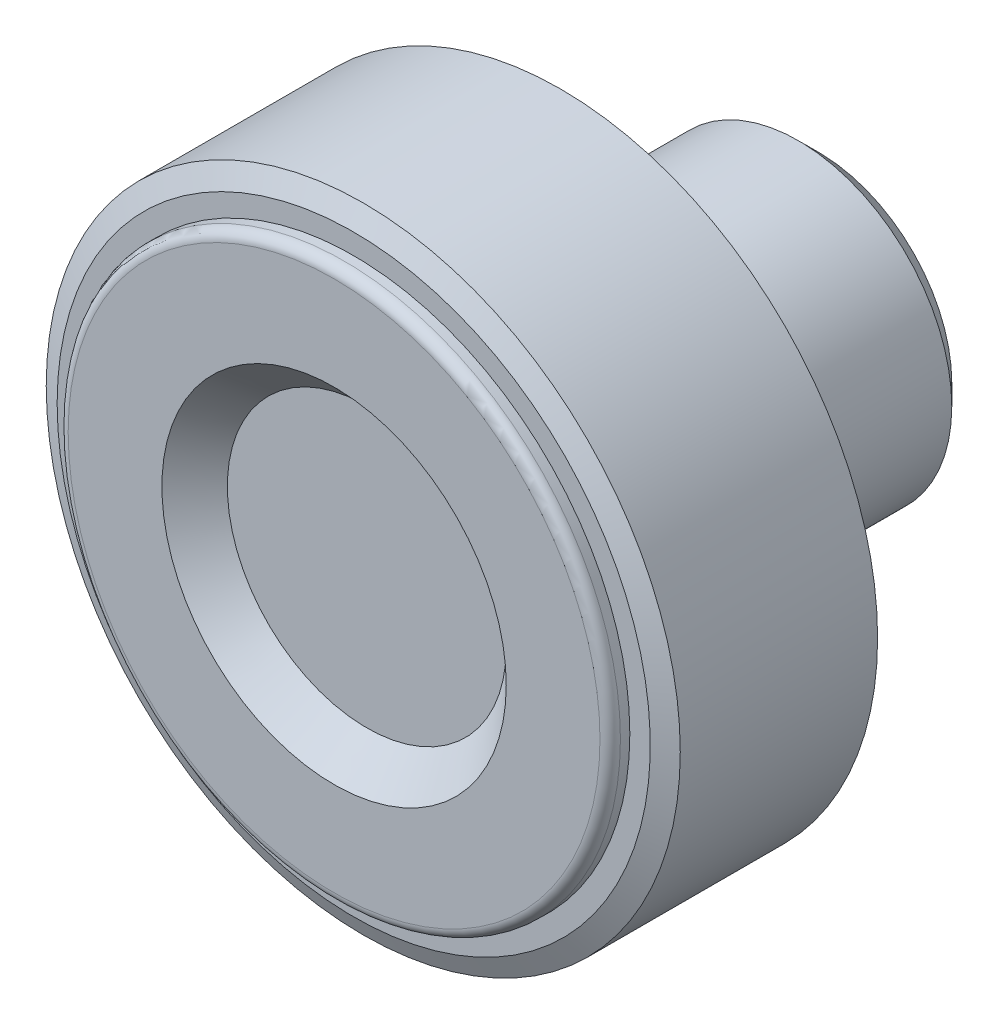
ISO-10303-21;
HEADER;
FILE_DESCRIPTION(('STEP AP214'),'2;1');
FILE_NAME('part.step','',(''),(''),'','','');
FILE_SCHEMA(('AUTOMOTIVE_DESIGN { 1 0 10303 214 1 1 1 1 }'));
ENDSEC;
DATA;
#1=APPLICATION_CONTEXT('core data for automotive mechanical design processes');
#2=APPLICATION_PROTOCOL_DEFINITION('international standard','automotive_design',2000,#1);
#3=PRODUCT_CONTEXT('',#1,'mechanical');
#4=PRODUCT('Part','Part','',(#3));
#5=PRODUCT_RELATED_PRODUCT_CATEGORY('part','',(#4));
#6=PRODUCT_DEFINITION_FORMATION('','',#4);
#7=PRODUCT_DEFINITION_CONTEXT('part definition',#1,'design');
#8=PRODUCT_DEFINITION('design','',#6,#7);
#9=PRODUCT_DEFINITION_SHAPE('','',#8);
#10=(LENGTH_UNIT() NAMED_UNIT(*) SI_UNIT(.MILLI.,.METRE.));
#11=(NAMED_UNIT(*) PLANE_ANGLE_UNIT() SI_UNIT($,.RADIAN.));
#12=(NAMED_UNIT(*) SI_UNIT($,.STERADIAN.) SOLID_ANGLE_UNIT());
#13=UNCERTAINTY_MEASURE_WITH_UNIT(LENGTH_MEASURE(1.E-05),#10,'distance_accuracy_value','');
#14=(GEOMETRIC_REPRESENTATION_CONTEXT(3) GLOBAL_UNCERTAINTY_ASSIGNED_CONTEXT((#13)) GLOBAL_UNIT_ASSIGNED_CONTEXT((#10,
#11,#12)) REPRESENTATION_CONTEXT('',''));
#15=CARTESIAN_POINT('',(0.,0.,0.));
#16=DIRECTION('',(0.,0.,1.));
#17=DIRECTION('',(1.,0.,0.));
#18=AXIS2_PLACEMENT_3D('',#15,#16,#17);
#19=CARTESIAN_POINT('',(0.,0.,0.));
#20=DIRECTION('',(0.,0.,-1.));
#21=DIRECTION('',(-1.,0.,0.));
#22=AXIS2_PLACEMENT_3D('',#19,#20,#21);
#23=CYLINDRICAL_SURFACE('',#22,15.5);
#24=CARTESIAN_POINT('',(0.,0.,22.573692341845));
#25=DIRECTION('',(0.,0.,-1.));
#26=DIRECTION('',(-1.,0.,0.));
#27=AXIS2_PLACEMENT_3D('',#24,#25,#26);
#28=CIRCLE('',#27,15.5);
#29=CARTESIAN_POINT('',(-15.5,0.,22.573692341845));
#30=VERTEX_POINT('',#29);
#31=EDGE_CURVE('E157',#30,#30,#28,.T.);
#32=ORIENTED_EDGE('',*,*,#31,.T.);
#33=EDGE_LOOP('',(#32));
#34=FACE_BOUND('',#33,.T.);
#35=CARTESIAN_POINT('',(0.,0.,12.926307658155));
#36=DIRECTION('',(0.,0.,1.));
#37=DIRECTION('',(0.,1.,0.));
#38=AXIS2_PLACEMENT_3D('',#35,#36,#37);
#39=CIRCLE('',#38,15.5);
#40=CARTESIAN_POINT('',(0.,15.5,12.926307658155));
#41=VERTEX_POINT('',#40);
#42=EDGE_CURVE('E153',#41,#41,#39,.F.);
#43=ORIENTED_EDGE('',*,*,#42,.F.);
#44=EDGE_LOOP('',(#43));
#45=FACE_BOUND('',#44,.T.);
#46=ADVANCED_FACE('F14',(#34,#45),#23,.T.);
#47=CARTESIAN_POINT('',(0.,0.,12.926307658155));
#48=DIRECTION('',(0.,0.,1.));
#49=DIRECTION('',(1.,0.,0.));
#50=AXIS2_PLACEMENT_3D('',#47,#48,#49);
#51=CONICAL_SURFACE('',#50,15.5,1.13446401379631);
#52=ORIENTED_EDGE('',*,*,#42,.T.);
#53=EDGE_LOOP('',(#52));
#54=FACE_BOUND('',#53,.T.);
#55=CARTESIAN_POINT('',(0.,0.,12.46));
#56=DIRECTION('',(0.,0.,1.));
#57=DIRECTION('',(1.,0.,0.));
#58=AXIS2_PLACEMENT_3D('',#55,#56,#57);
#59=CIRCLE('',#58,14.5);
#60=CARTESIAN_POINT('',(14.5,0.,12.46));
#61=VERTEX_POINT('',#60);
#62=EDGE_CURVE('E150',#61,#61,#59,.F.);
#63=ORIENTED_EDGE('',*,*,#62,.F.);
#64=EDGE_LOOP('',(#63));
#65=FACE_BOUND('',#64,.T.);
#66=ADVANCED_FACE('F397',(#54,#65),#51,.T.);
#67=CARTESIAN_POINT('',(0.,14.,12.46));
#68=DIRECTION('',(0.,0.,-1.));
#69=DIRECTION('',(-1.,0.,0.));
#70=AXIS2_PLACEMENT_3D('',#67,#68,#69);
#71=PLANE('',#70);
#72=ORIENTED_EDGE('',*,*,#62,.T.);
#73=EDGE_LOOP('',(#72));
#74=FACE_BOUND('',#73,.T.);
#75=CARTESIAN_POINT('',(0.,0.,12.46));
#76=DIRECTION('',(0.,0.,1.));
#77=DIRECTION('',(1.,0.,0.));
#78=AXIS2_PLACEMENT_3D('',#75,#76,#77);
#79=CIRCLE('',#78,13.5);
#80=CARTESIAN_POINT('',(13.5,0.,12.46));
#81=VERTEX_POINT('',#80);
#82=EDGE_CURVE('E146',#81,#81,#79,.F.);
#83=ORIENTED_EDGE('',*,*,#82,.F.);
#84=EDGE_LOOP('',(#83));
#85=FACE_BOUND('',#84,.T.);
#86=ADVANCED_FACE('F407',(#74,#85),#71,.T.);
#87=CARTESIAN_POINT('',(0.,0.,12.23));
#88=DIRECTION('',(0.,0.,1.));
#89=DIRECTION('',(1.,0.,0.));
#90=AXIS2_PLACEMENT_3D('',#87,#88,#89);
#91=CYLINDRICAL_SURFACE('',#90,13.5);
#92=ORIENTED_EDGE('',*,*,#82,.T.);
#93=EDGE_LOOP('',(#92));
#94=FACE_BOUND('',#93,.T.);
#95=CARTESIAN_POINT('',(0.,0.,12.));
#96=DIRECTION('',(0.,0.,-1.));
#97=DIRECTION('',(-1.,0.,0.));
#98=AXIS2_PLACEMENT_3D('',#95,#96,#97);
#99=CIRCLE('',#98,13.5);
#100=CARTESIAN_POINT('',(-13.5,0.,12.));
#101=VERTEX_POINT('',#100);
#102=EDGE_CURVE('E149',#101,#101,#99,.T.);
#103=ORIENTED_EDGE('',*,*,#102,.F.);
#104=EDGE_LOOP('',(#103));
#105=FACE_BOUND('',#104,.T.);
#106=ADVANCED_FACE('F583',(#94,#105),#91,.T.);
#107=CARTESIAN_POINT('',(0.,0.,12.));
#108=DIRECTION('',(0.,0.,-1.));
#109=DIRECTION('',(-1.,0.,0.));
#110=AXIS2_PLACEMENT_3D('',#107,#108,#109);
#111=TOROIDAL_SURFACE('',#110,13.,0.5);
#112=ORIENTED_EDGE('',*,*,#102,.T.);
#113=EDGE_LOOP('',(#112));
#114=FACE_BOUND('',#113,.T.);
#115=CARTESIAN_POINT('',(0.,0.,11.5));
#116=DIRECTION('',(0.,0.,1.));
#117=DIRECTION('',(1.,0.,0.));
#118=AXIS2_PLACEMENT_3D('',#115,#116,#117);
#119=CIRCLE('',#118,13.);
#120=CARTESIAN_POINT('',(0.,13.,11.5));
#121=VERTEX_POINT('',#120);
#122=CARTESIAN_POINT('',(13.,0.,11.5));
#123=VERTEX_POINT('',#122);
#124=EDGE_CURVE('E305',#121,#123,#119,.F.);
#125=ORIENTED_EDGE('',*,*,#124,.F.);
#126=CARTESIAN_POINT('',(0.,0.,11.5));
#127=DIRECTION('',(0.,0.,1.));
#128=DIRECTION('',(0.,1.,0.));
#129=AXIS2_PLACEMENT_3D('',#126,#127,#128);
#130=CIRCLE('',#129,13.);
#131=CARTESIAN_POINT('',(-13.,0.,11.5));
#132=VERTEX_POINT('',#131);
#133=EDGE_CURVE('E145',#132,#121,#130,.F.);
#134=ORIENTED_EDGE('',*,*,#133,.F.);
#135=CARTESIAN_POINT('',(0.,0.,11.5));
#136=DIRECTION('',(0.,0.,1.));
#137=DIRECTION('',(-1.,0.,0.));
#138=AXIS2_PLACEMENT_3D('',#135,#136,#137);
#139=CIRCLE('',#138,13.);
#140=EDGE_CURVE('E340',#123,#132,#139,.F.);
#141=ORIENTED_EDGE('',*,*,#140,.F.);
#142=EDGE_LOOP('',(#125,#134,#141));
#143=FACE_BOUND('',#142,.T.);
#144=ADVANCED_FACE('F322',(#114,#143),#111,.T.);
#145=CARTESIAN_POINT('',(0.,12.4615384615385,11.5));
#146=DIRECTION('',(0.,0.,-1.));
#147=DIRECTION('',(-1.,0.,0.));
#148=AXIS2_PLACEMENT_3D('',#145,#146,#147);
#149=PLANE('',#148);
#150=ORIENTED_EDGE('',*,*,#140,.T.);
#151=ORIENTED_EDGE('',*,*,#133,.T.);
#152=ORIENTED_EDGE('',*,*,#124,.T.);
#153=EDGE_LOOP('',(#150,#151,#152));
#154=FACE_BOUND('',#153,.T.);
#155=CARTESIAN_POINT('',(0.,0.,11.5));
#156=DIRECTION('',(0.,0.,1.));
#157=DIRECTION('',(1.,0.,0.));
#158=AXIS2_PLACEMENT_3D('',#155,#156,#157);
#159=CIRCLE('',#158,11.9230769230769);
#160=CARTESIAN_POINT('',(11.9230769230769,0.,11.5));
#161=VERTEX_POINT('',#160);
#162=EDGE_CURVE('E142',#161,#161,#159,.T.);
#163=ORIENTED_EDGE('',*,*,#162,.T.);
#164=EDGE_LOOP('',(#163));
#165=FACE_BOUND('',#164,.T.);
#166=ADVANCED_FACE('F311',(#154,#165),#149,.T.);
#167=CARTESIAN_POINT('',(0.,1.66666666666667,0.));
#168=DIRECTION('',(0.,0.,-1.));
#169=DIRECTION('',(-1.,0.,0.));
#170=AXIS2_PLACEMENT_3D('',#167,#168,#169);
#171=PLANE('',#170);
#172=CARTESIAN_POINT('',(0.,0.,0.));
#173=DIRECTION('',(0.,0.,-1.));
#174=DIRECTION('',(-1.,0.,0.));
#175=AXIS2_PLACEMENT_3D('',#172,#173,#174);
#176=CIRCLE('',#175,2.94999999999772);
#177=CARTESIAN_POINT('',(-2.94999999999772,0.,0.));
#178=VERTEX_POINT('',#177);
#179=EDGE_CURVE('E9',#178,#178,#176,.F.);
#180=ORIENTED_EDGE('',*,*,#179,.T.);
#181=EDGE_LOOP('',(#180));
#182=FACE_BOUND('',#181,.T.);
#183=CARTESIAN_POINT('',(0.,0.,0.));
#184=DIRECTION('',(0.,0.,1.));
#185=DIRECTION('',(1.,0.,0.));
#186=AXIS2_PLACEMENT_3D('',#183,#184,#185);
#187=CIRCLE('',#186,3.33333333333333);
#188=CARTESIAN_POINT('',(3.33333333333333,0.,0.));
#189=VERTEX_POINT('',#188);
#190=EDGE_CURVE('E139',#189,#189,#187,.T.);
#191=ORIENTED_EDGE('',*,*,#190,.F.);
#192=EDGE_LOOP('',(#191));
#193=FACE_BOUND('',#192,.T.);
#194=ADVANCED_FACE('F321',(#182,#193),#171,.T.);
#195=CARTESIAN_POINT('',(0.,0.,15.25));
#196=DIRECTION('',(0.,0.,1.));
#197=DIRECTION('',(1.,0.,0.));
#198=AXIS2_PLACEMENT_3D('',#195,#196,#197);
#199=CYLINDRICAL_SURFACE('',#198,11.9230769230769);
#200=CARTESIAN_POINT('',(0.,0.,19.));
#201=DIRECTION('',(0.,0.,-1.));
#202=DIRECTION('',(-1.,0.,0.));
#203=AXIS2_PLACEMENT_3D('',#200,#201,#202);
#204=CIRCLE('',#203,11.9230769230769);
#205=CARTESIAN_POINT('',(-11.9230769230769,0.,19.));
#206=VERTEX_POINT('',#205);
#207=EDGE_CURVE('E138',#206,#206,#204,.F.);
#208=ORIENTED_EDGE('',*,*,#207,.T.);
#209=EDGE_LOOP('',(#208));
#210=FACE_BOUND('',#209,.T.);
#211=ORIENTED_EDGE('',*,*,#162,.F.);
#212=EDGE_LOOP('',(#211));
#213=FACE_BOUND('',#212,.T.);
#214=ADVANCED_FACE('F449',(#210,#213),#199,.F.);
#215=CARTESIAN_POINT('',(0.,0.,0.15));
#216=DIRECTION('',(0.,0.,1.));
#217=DIRECTION('',(1.,0.,0.));
#218=AXIS2_PLACEMENT_3D('',#215,#216,#217);
#219=CYLINDRICAL_SURFACE('',#218,3.33333333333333);
#220=ORIENTED_EDGE('',*,*,#190,.T.);
#221=EDGE_LOOP('',(#220));
#222=FACE_BOUND('',#221,.T.);
#223=CARTESIAN_POINT('',(0.,0.,0.3));
#224=DIRECTION('',(0.,0.,1.));
#225=DIRECTION('',(1.,0.,0.));
#226=AXIS2_PLACEMENT_3D('',#223,#224,#225);
#227=CIRCLE('',#226,3.33333333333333);
#228=CARTESIAN_POINT('',(3.33333333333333,0.,0.3));
#229=VERTEX_POINT('',#228);
#230=EDGE_CURVE('E134',#229,#229,#227,.T.);
#231=ORIENTED_EDGE('',*,*,#230,.F.);
#232=EDGE_LOOP('',(#231));
#233=FACE_BOUND('',#232,.T.);
#234=ADVANCED_FACE('F281',(#222,#233),#219,.T.);
#235=CARTESIAN_POINT('',(0.,0.,19.));
#236=DIRECTION('',(0.,0.,-1.));
#237=DIRECTION('',(-1.,0.,0.));
#238=AXIS2_PLACEMENT_3D('',#235,#236,#237);
#239=TOROIDAL_SURFACE('',#238,10.9230769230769,1.);
#240=CARTESIAN_POINT('',(0.,0.,20.));
#241=DIRECTION('',(0.,0.,1.));
#242=DIRECTION('',(0.,1.,0.));
#243=AXIS2_PLACEMENT_3D('',#240,#241,#242);
#244=CIRCLE('',#243,10.9230769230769);
#245=CARTESIAN_POINT('',(-10.9230769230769,0.,20.));
#246=VERTEX_POINT('',#245);
#247=CARTESIAN_POINT('',(0.,10.9230769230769,20.));
#248=VERTEX_POINT('',#247);
#249=EDGE_CURVE('E133',#246,#248,#244,.F.);
#250=ORIENTED_EDGE('',*,*,#249,.F.);
#251=CARTESIAN_POINT('',(0.,0.,20.));
#252=DIRECTION('',(0.,0.,1.));
#253=DIRECTION('',(-1.,0.,0.));
#254=AXIS2_PLACEMENT_3D('',#251,#252,#253);
#255=CIRCLE('',#254,10.9230769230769);
#256=CARTESIAN_POINT('',(10.9230769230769,0.,20.));
#257=VERTEX_POINT('',#256);
#258=EDGE_CURVE('E656',#257,#246,#255,.F.);
#259=ORIENTED_EDGE('',*,*,#258,.F.);
#260=CARTESIAN_POINT('',(0.,0.,20.));
#261=DIRECTION('',(0.,0.,1.));
#262=DIRECTION('',(1.,0.,0.));
#263=AXIS2_PLACEMENT_3D('',#260,#261,#262);
#264=CIRCLE('',#263,10.9230769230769);
#265=EDGE_CURVE('E137',#248,#257,#264,.F.);
#266=ORIENTED_EDGE('',*,*,#265,.F.);
#267=EDGE_LOOP('',(#250,#259,#266));
#268=FACE_BOUND('',#267,.T.);
#269=ORIENTED_EDGE('',*,*,#207,.F.);
#270=EDGE_LOOP('',(#269));
#271=FACE_BOUND('',#270,.T.);
#272=ADVANCED_FACE('F277',(#268,#271),#239,.F.);
#273=CARTESIAN_POINT('',(0.,4.91666666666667,0.3));
#274=DIRECTION('',(0.,0.,-1.));
#275=DIRECTION('',(-1.,0.,0.));
#276=AXIS2_PLACEMENT_3D('',#273,#274,#275);
#277=PLANE('',#276);
#278=CARTESIAN_POINT('',(0.,0.,0.3));
#279=DIRECTION('',(0.,0.,1.));
#280=DIRECTION('',(1.,0.,0.));
#281=AXIS2_PLACEMENT_3D('',#278,#279,#280);
#282=CIRCLE('',#281,6.5);
#283=CARTESIAN_POINT('',(6.5,0.,0.3));
#284=VERTEX_POINT('',#283);
#285=EDGE_CURVE('E124',#284,#284,#282,.T.);
#286=ORIENTED_EDGE('',*,*,#285,.F.);
#287=EDGE_LOOP('',(#286));
#288=FACE_BOUND('',#287,.T.);
#289=ORIENTED_EDGE('',*,*,#230,.T.);
#290=EDGE_LOOP('',(#289));
#291=FACE_BOUND('',#290,.T.);
#292=ADVANCED_FACE('F214',(#288,#291),#277,.T.);
#293=CARTESIAN_POINT('',(0.,9.71153846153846,20.));
#294=DIRECTION('',(0.,0.,-1.));
#295=DIRECTION('',(-1.,0.,0.));
#296=AXIS2_PLACEMENT_3D('',#293,#294,#295);
#297=PLANE('',#296);
#298=ORIENTED_EDGE('',*,*,#258,.T.);
#299=ORIENTED_EDGE('',*,*,#249,.T.);
#300=ORIENTED_EDGE('',*,*,#265,.T.);
#301=EDGE_LOOP('',(#298,#299,#300));
#302=FACE_BOUND('',#301,.T.);
#303=CARTESIAN_POINT('',(0.,0.,20.));
#304=DIRECTION('',(0.,0.,-1.));
#305=DIRECTION('',(-1.,0.,0.));
#306=AXIS2_PLACEMENT_3D('',#303,#304,#305);
#307=CIRCLE('',#306,8.5);
#308=CARTESIAN_POINT('',(0.,8.5,20.));
#309=VERTEX_POINT('',#308);
#310=CARTESIAN_POINT('',(-8.5,0.,20.));
#311=VERTEX_POINT('',#310);
#312=EDGE_CURVE('E31',#309,#311,#307,.F.);
#313=ORIENTED_EDGE('',*,*,#312,.T.);
#314=CARTESIAN_POINT('',(0.,0.,20.));
#315=DIRECTION('',(0.,0.,-1.));
#316=DIRECTION('',(1.,0.,0.));
#317=AXIS2_PLACEMENT_3D('',#314,#315,#316);
#318=CIRCLE('',#317,8.5);
#319=CARTESIAN_POINT('',(8.5,0.,20.));
#320=VERTEX_POINT('',#319);
#321=EDGE_CURVE('E132',#311,#320,#318,.F.);
#322=ORIENTED_EDGE('',*,*,#321,.T.);
#323=CARTESIAN_POINT('',(0.,0.,20.));
#324=DIRECTION('',(0.,0.,-1.));
#325=DIRECTION('',(0.,1.,0.));
#326=AXIS2_PLACEMENT_3D('',#323,#324,#325);
#327=CIRCLE('',#326,8.5);
#328=EDGE_CURVE('E201',#320,#309,#327,.F.);
#329=ORIENTED_EDGE('',*,*,#328,.T.);
#330=EDGE_LOOP('',(#313,#322,#329));
#331=FACE_BOUND('',#330,.T.);
#332=ADVANCED_FACE('F205',(#302,#331),#297,.T.);
#333=CARTESIAN_POINT('',(0.,0.,1.3));
#334=DIRECTION('',(0.,0.,1.));
#335=DIRECTION('',(1.,0.,0.));
#336=AXIS2_PLACEMENT_3D('',#333,#334,#335);
#337=CONICAL_SURFACE('',#336,7.5,0.785398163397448);
#338=ORIENTED_EDGE('',*,*,#285,.T.);
#339=EDGE_LOOP('',(#338));
#340=FACE_BOUND('',#339,.T.);
#341=CARTESIAN_POINT('',(0.,0.,1.3));
#342=DIRECTION('',(0.,0.,1.));
#343=DIRECTION('',(1.,0.,0.));
#344=AXIS2_PLACEMENT_3D('',#341,#342,#343);
#345=CIRCLE('',#344,7.5);
#346=CARTESIAN_POINT('',(7.5,0.,1.3));
#347=VERTEX_POINT('',#346);
#348=EDGE_CURVE('E266',#347,#347,#345,.T.);
#349=ORIENTED_EDGE('',*,*,#348,.F.);
#350=EDGE_LOOP('',(#349));
#351=FACE_BOUND('',#350,.T.);
#352=ADVANCED_FACE('F188',(#340,#351),#337,.T.);
#353=CARTESIAN_POINT('',(0.,0.,19.));
#354=DIRECTION('',(0.,0.,-1.));
#355=DIRECTION('',(-1.,0.,0.));
#356=AXIS2_PLACEMENT_3D('',#353,#354,#355);
#357=TOROIDAL_SURFACE('',#356,8.5,1.);
#358=CARTESIAN_POINT('',(0.,0.,19.));
#359=DIRECTION('',(0.,0.,1.));
#360=DIRECTION('',(1.,0.,0.));
#361=AXIS2_PLACEMENT_3D('',#358,#359,#360);
#362=CIRCLE('',#361,7.5);
#363=CARTESIAN_POINT('',(7.5,0.,19.));
#364=VERTEX_POINT('',#363);
#365=EDGE_CURVE('E198',#364,#364,#362,.F.);
#366=ORIENTED_EDGE('',*,*,#365,.F.);
#367=EDGE_LOOP('',(#366));
#368=FACE_BOUND('',#367,.T.);
#369=ORIENTED_EDGE('',*,*,#321,.F.);
#370=ORIENTED_EDGE('',*,*,#312,.F.);
#371=ORIENTED_EDGE('',*,*,#328,.F.);
#372=EDGE_LOOP('',(#369,#370,#371));
#373=FACE_BOUND('',#372,.T.);
#374=ADVANCED_FACE('F176',(#368,#373),#357,.F.);
#375=CARTESIAN_POINT('',(0.,0.,10.15));
#376=DIRECTION('',(0.,0.,1.));
#377=DIRECTION('',(1.,0.,0.));
#378=AXIS2_PLACEMENT_3D('',#375,#376,#377);
#379=CYLINDRICAL_SURFACE('',#378,7.5);
#380=ORIENTED_EDGE('',*,*,#348,.T.);
#381=EDGE_LOOP('',(#380));
#382=FACE_BOUND('',#381,.T.);
#383=ORIENTED_EDGE('',*,*,#365,.T.);
#384=EDGE_LOOP('',(#383));
#385=FACE_BOUND('',#384,.T.);
#386=ADVANCED_FACE('F187',(#382,#385),#379,.T.);
#387=CARTESIAN_POINT('',(0.,3.40909090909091,22.4));
#388=DIRECTION('',(0.,0.,1.));
#389=DIRECTION('',(1.,0.,0.));
#390=AXIS2_PLACEMENT_3D('',#387,#388,#389);
#391=PLANE('',#390);
#392=CARTESIAN_POINT('',(0.,0.,22.4));
#393=DIRECTION('',(0.,0.,1.));
#394=DIRECTION('',(1.,0.,0.));
#395=AXIS2_PLACEMENT_3D('',#392,#393,#394);
#396=CIRCLE('',#395,6.81818181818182);
#397=CARTESIAN_POINT('',(6.81818181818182,0.,22.4));
#398=VERTEX_POINT('',#397);
#399=EDGE_CURVE('E164',#398,#398,#396,.T.);
#400=ORIENTED_EDGE('',*,*,#399,.T.);
#401=EDGE_LOOP('',(#400));
#402=FACE_BOUND('',#401,.T.);
#403=ADVANCED_FACE('F366',(#402),#391,.T.);
#404=CARTESIAN_POINT('',(0.,0.,24.));
#405=DIRECTION('',(0.,0.,1.));
#406=DIRECTION('',(1.,0.,0.));
#407=AXIS2_PLACEMENT_3D('',#404,#405,#406);
#408=CONICAL_SURFACE('',#407,8.41818181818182,0.785398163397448);
#409=CARTESIAN_POINT('',(0.,0.,24.));
#410=DIRECTION('',(0.,0.,1.));
#411=DIRECTION('',(1.,0.,0.));
#412=AXIS2_PLACEMENT_3D('',#409,#410,#411);
#413=CIRCLE('',#412,8.41818181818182);
#414=CARTESIAN_POINT('',(8.41818181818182,0.,24.));
#415=VERTEX_POINT('',#414);
#416=EDGE_CURVE('E75',#415,#415,#413,.F.);
#417=ORIENTED_EDGE('',*,*,#416,.F.);
#418=EDGE_LOOP('',(#417));
#419=FACE_BOUND('',#418,.T.);
#420=ORIENTED_EDGE('',*,*,#399,.F.);
#421=EDGE_LOOP('',(#420));
#422=FACE_BOUND('',#421,.T.);
#423=ADVANCED_FACE('F98',(#419,#422),#408,.F.);
#424=CARTESIAN_POINT('',(0.,10.7090909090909,24.));
#425=DIRECTION('',(0.,0.,1.));
#426=DIRECTION('',(1.,0.,0.));
#427=AXIS2_PLACEMENT_3D('',#424,#425,#426);
#428=PLANE('',#427);
#429=ORIENTED_EDGE('',*,*,#416,.T.);
#430=EDGE_LOOP('',(#429));
#431=FACE_BOUND('',#430,.T.);
#432=CARTESIAN_POINT('',(0.,0.,24.));
#433=DIRECTION('',(0.,0.,-1.));
#434=DIRECTION('',(-1.,0.,0.));
#435=AXIS2_PLACEMENT_3D('',#432,#433,#434);
#436=CIRCLE('',#435,13.);
#437=CARTESIAN_POINT('',(-13.,0.,24.));
#438=VERTEX_POINT('',#437);
#439=CARTESIAN_POINT('',(0.,13.,24.));
#440=VERTEX_POINT('',#439);
#441=EDGE_CURVE('E69',#438,#440,#436,.T.);
#442=ORIENTED_EDGE('',*,*,#441,.F.);
#443=CARTESIAN_POINT('',(0.,0.,24.));
#444=DIRECTION('',(0.,0.,-1.));
#445=DIRECTION('',(1.,0.,0.));
#446=AXIS2_PLACEMENT_3D('',#443,#444,#445);
#447=CIRCLE('',#446,13.);
#448=CARTESIAN_POINT('',(13.,0.,24.));
#449=VERTEX_POINT('',#448);
#450=EDGE_CURVE('E64',#449,#438,#447,.T.);
#451=ORIENTED_EDGE('',*,*,#450,.F.);
#452=CARTESIAN_POINT('',(0.,0.,24.));
#453=DIRECTION('',(0.,0.,-1.));
#454=DIRECTION('',(0.,1.,0.));
#455=AXIS2_PLACEMENT_3D('',#452,#453,#454);
#456=CIRCLE('',#455,13.);
#457=EDGE_CURVE('E71',#440,#449,#456,.T.);
#458=ORIENTED_EDGE('',*,*,#457,.F.);
#459=EDGE_LOOP('',(#442,#451,#458));
#460=FACE_BOUND('',#459,.T.);
#461=ADVANCED_FACE('F79',(#431,#460),#428,.T.);
#462=CARTESIAN_POINT('',(0.,0.,23.5));
#463=DIRECTION('',(0.,0.,-1.));
#464=DIRECTION('',(-1.,0.,0.));
#465=AXIS2_PLACEMENT_3D('',#462,#463,#464);
#466=TOROIDAL_SURFACE('',#465,13.,0.5);
#467=ORIENTED_EDGE('',*,*,#450,.T.);
#468=ORIENTED_EDGE('',*,*,#441,.T.);
#469=ORIENTED_EDGE('',*,*,#457,.T.);
#470=EDGE_LOOP('',(#467,#468,#469));
#471=FACE_BOUND('',#470,.T.);
#472=CARTESIAN_POINT('',(0.,0.,23.5));
#473=DIRECTION('',(0.,0.,1.));
#474=DIRECTION('',(1.,0.,0.));
#475=AXIS2_PLACEMENT_3D('',#472,#473,#474);
#476=CIRCLE('',#475,13.5);
#477=CARTESIAN_POINT('',(13.5,0.,23.5));
#478=VERTEX_POINT('',#477);
#479=EDGE_CURVE('E161',#478,#478,#476,.F.);
#480=ORIENTED_EDGE('',*,*,#479,.F.);
#481=EDGE_LOOP('',(#480));
#482=FACE_BOUND('',#481,.T.);
#483=ADVANCED_FACE('F67',(#471,#482),#466,.T.);
#484=CARTESIAN_POINT('',(0.,0.,23.27));
#485=DIRECTION('',(0.,0.,1.));
#486=DIRECTION('',(1.,0.,0.));
#487=AXIS2_PLACEMENT_3D('',#484,#485,#486);
#488=CYLINDRICAL_SURFACE('',#487,13.5);
#489=CARTESIAN_POINT('',(0.,0.,23.04));
#490=DIRECTION('',(0.,0.,1.));
#491=DIRECTION('',(1.,0.,0.));
#492=AXIS2_PLACEMENT_3D('',#489,#490,#491);
#493=CIRCLE('',#492,13.5);
#494=CARTESIAN_POINT('',(13.5,0.,23.04));
#495=VERTEX_POINT('',#494);
#496=EDGE_CURVE('E158',#495,#495,#493,.F.);
#497=ORIENTED_EDGE('',*,*,#496,.F.);
#498=EDGE_LOOP('',(#497));
#499=FACE_BOUND('',#498,.T.);
#500=ORIENTED_EDGE('',*,*,#479,.T.);
#501=EDGE_LOOP('',(#500));
#502=FACE_BOUND('',#501,.T.);
#503=ADVANCED_FACE('F356',(#499,#502),#488,.T.);
#504=CARTESIAN_POINT('',(0.,0.,22.573692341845));
#505=DIRECTION('',(0.,0.,-1.));
#506=DIRECTION('',(-1.,0.,0.));
#507=AXIS2_PLACEMENT_3D('',#504,#505,#506);
#508=CONICAL_SURFACE('',#507,15.5,1.13446401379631);
#509=ORIENTED_EDGE('',*,*,#31,.F.);
#510=EDGE_LOOP('',(#509));
#511=FACE_BOUND('',#510,.T.);
#512=CARTESIAN_POINT('',(0.,0.,23.04));
#513=DIRECTION('',(0.,0.,-1.));
#514=DIRECTION('',(-1.,0.,0.));
#515=AXIS2_PLACEMENT_3D('',#512,#513,#514);
#516=CIRCLE('',#515,14.5);
#517=CARTESIAN_POINT('',(-14.5,0.,23.04));
#518=VERTEX_POINT('',#517);
#519=EDGE_CURVE('E154',#518,#518,#516,.T.);
#520=ORIENTED_EDGE('',*,*,#519,.T.);
#521=EDGE_LOOP('',(#520));
#522=FACE_BOUND('',#521,.T.);
#523=ADVANCED_FACE('F363',(#511,#522),#508,.T.);
#524=CARTESIAN_POINT('',(0.,14.,23.04));
#525=DIRECTION('',(0.,0.,1.));
#526=DIRECTION('',(1.,0.,0.));
#527=AXIS2_PLACEMENT_3D('',#524,#525,#526);
#528=PLANE('',#527);
#529=ORIENTED_EDGE('',*,*,#496,.T.);
#530=EDGE_LOOP('',(#529));
#531=FACE_BOUND('',#530,.T.);
#532=ORIENTED_EDGE('',*,*,#519,.F.);
#533=EDGE_LOOP('',(#532));
#534=FACE_BOUND('',#533,.T.);
#535=ADVANCED_FACE('F413',(#531,#534),#528,.T.);
#536=CARTESIAN_POINT('',(0.,0.,10.));
#537=DIRECTION('',(0.,0.,-1.));
#538=DIRECTION('',(-1.,0.,0.));
#539=AXIS2_PLACEMENT_3D('',#536,#537,#538);
#540=PLANE('',#539);
#541=CARTESIAN_POINT('',(0.,0.,10.));
#542=DIRECTION('',(0.,0.,-1.));
#543=DIRECTION('',(-1.,0.,0.));
#544=AXIS2_PLACEMENT_3D('',#541,#542,#543);
#545=CIRCLE('',#544,2.49999999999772);
#546=CARTESIAN_POINT('',(-2.49999999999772,0.,10.));
#547=VERTEX_POINT('',#546);
#548=EDGE_CURVE('E167',#547,#547,#545,.T.);
#549=ORIENTED_EDGE('',*,*,#548,.T.);
#550=EDGE_LOOP('',(#549));
#551=FACE_BOUND('',#550,.T.);
#552=ADVANCED_FACE('F416',(#551),#540,.T.);
#553=CARTESIAN_POINT('',(0.,0.,10.));
#554=DIRECTION('',(0.,0.,-1.));
#555=DIRECTION('',(-1.,0.,0.));
#556=AXIS2_PLACEMENT_3D('',#553,#554,#555);
#557=CYLINDRICAL_SURFACE('',#556,2.49999999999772);
#558=CARTESIAN_POINT('',(0.,0.,0.449999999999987));
#559=DIRECTION('',(0.,0.,-1.));
#560=DIRECTION('',(-1.,0.,0.));
#561=AXIS2_PLACEMENT_3D('',#558,#559,#560);
#562=CIRCLE('',#561,2.49999999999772);
#563=CARTESIAN_POINT('',(-2.49999999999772,0.,0.449999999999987));
#564=VERTEX_POINT('',#563);
#565=EDGE_CURVE('E23',#564,#564,#562,.T.);
#566=ORIENTED_EDGE('',*,*,#565,.T.);
#567=EDGE_LOOP('',(#566));
#568=FACE_BOUND('',#567,.T.);
#569=ORIENTED_EDGE('',*,*,#548,.F.);
#570=EDGE_LOOP('',(#569));
#571=FACE_BOUND('',#570,.T.);
#572=ADVANCED_FACE('F422',(#568,#571),#557,.F.);
#573=CARTESIAN_POINT('',(0.,0.,0.449999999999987));
#574=DIRECTION('',(0.,0.,-1.));
#575=DIRECTION('',(-1.,0.,0.));
#576=AXIS2_PLACEMENT_3D('',#573,#574,#575);
#577=CONICAL_SURFACE('',#576,2.49999999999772,0.785398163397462);
#578=ORIENTED_EDGE('',*,*,#179,.F.);
#579=EDGE_LOOP('',(#578));
#580=FACE_BOUND('',#579,.T.);
#581=ORIENTED_EDGE('',*,*,#565,.F.);
#582=EDGE_LOOP('',(#581));
#583=FACE_BOUND('',#582,.T.);
#584=ADVANCED_FACE('F16',(#580,#583),#577,.F.);
#585=CLOSED_SHELL('',(#46,#66,#86,#106,#144,#166,#194,#214,#234,#272,#292,#332,#352,#374,#386,
#403,#423,#461,#483,#503,#523,#535,#552,#572,#584));
#586=MANIFOLD_SOLID_BREP('B1',#585);
#587=ADVANCED_BREP_SHAPE_REPRESENTATION('',(#18,#586),#14);
#588=SHAPE_DEFINITION_REPRESENTATION(#9,#587);
ENDSEC;
END-ISO-10303-21;
